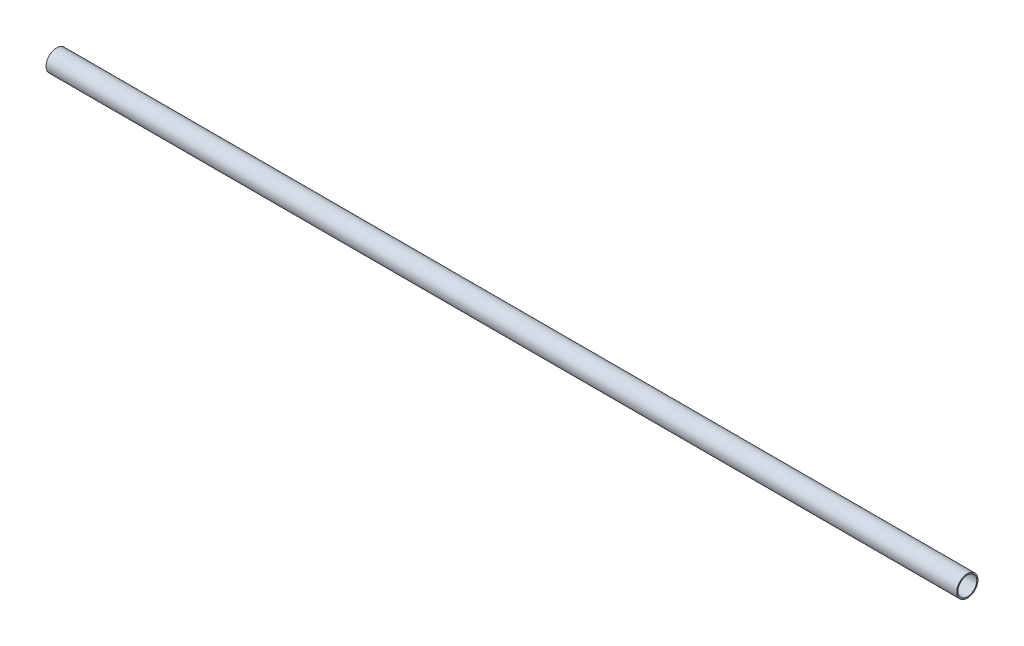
from build123d import *

# Parameters (mm, degrees)
ESQUISSE1_R        = 17.5
ESQUISSE1_R_2      = 15.5
BOSS_EXTRU_1_DEPTH = 1500


with BuildPart() as part:
    # Esquisse1 → Boss.-Extru.1 (new body)
    with BuildSketch(Plane(origin=(0, 0, 0), x_dir=(0, 0, -1), z_dir=(1, 0, 0))):
        Circle(ESQUISSE1_R)
        Circle(ESQUISSE1_R_2, mode=Mode.SUBTRACT)
    extrude(amount=BOSS_EXTRU_1_DEPTH)


solid = part.part
